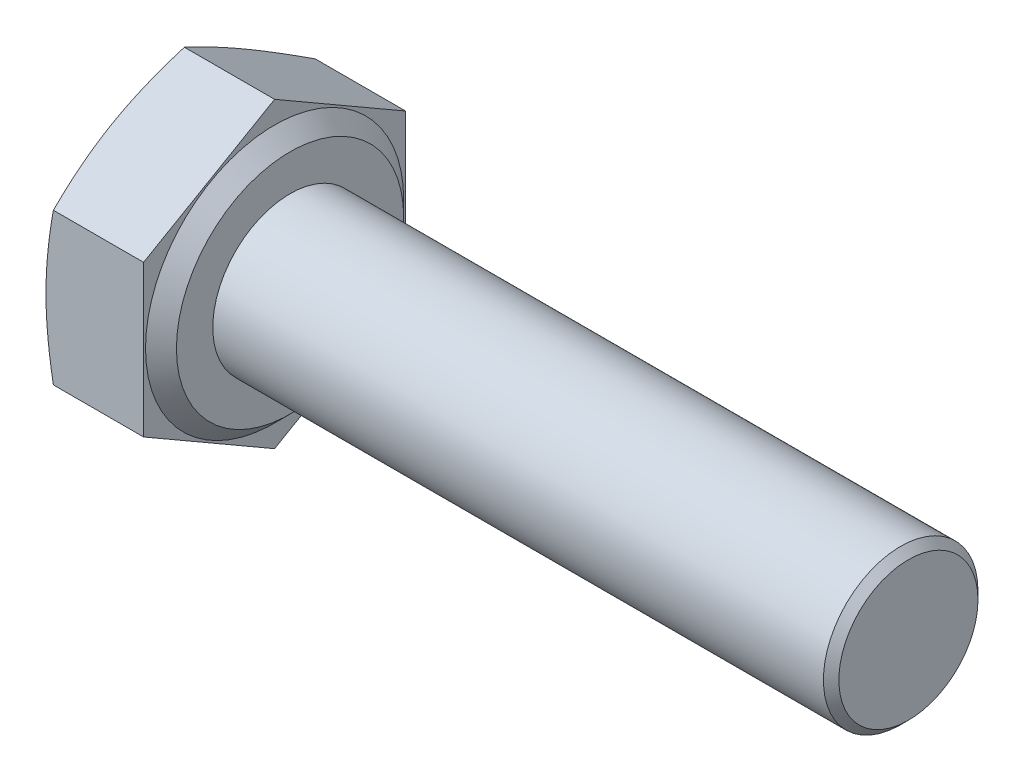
from build123d import *

# Parameters (mm, degrees)
BASEHEAD_DEPTH = 2.925
SKETCH5_R      = 2
BASEBODY_DEPTH = 16
CHAMFER1_SIZE  = 0.2


with BuildPart() as part:
    # Sketch2 → BaseHead (new body)
    with BuildSketch(Plane(origin=(0, 0, 0), x_dir=(0, 0, -1), z_dir=(1, 0, 0))):
        Polygon((3.39, -1.957217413), (3.39, 1.957217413), (0, 3.914434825), (-3.39, 1.957217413), (-3.39, -1.957217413), (0, -3.914434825), align=None)
    extrude(amount=BASEHEAD_DEPTH)

    # Sketch3 → BearingFace (revolve, cut)
    with BuildSketch(Plane.XY, mode=Mode.PRIVATE) as bearingface_sk:
        Polygon((2.925, 3.914434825), (2.925, 2.94), (2.525, 3.34), (2.525, 3.914434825), align=None)
    revolve(bearingface_sk.sketch.rotate(Axis((-0.957090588, 0, 0), (1, 0, 0)), 90), axis=Axis((-0.957090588, 0, 0), (1, 0, 0)), mode=Mode.SUBTRACT)

    # Sketch4 → HeadChamfer (revolve, cut)
    with BuildSketch(Plane.XY):
        Polygon((0, 3.914434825), (0.190878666, 3.914434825), (0, 3.39), align=None)
    revolve(axis=Axis((-0.493528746, 0, 0), (1, 0, 0)), mode=Mode.SUBTRACT)

    # Sketch5 → BaseBody (add)
    with BuildSketch(Plane(origin=(2.925, 0, 0), x_dir=(0, 0, -1), z_dir=(1, 0, 0))):
        Circle(SKETCH5_R)
    extrude(amount=BASEBODY_DEPTH)

    # Chamfer1
    chamfer1_edges = [part.edges().sort_by_distance(p)[0] for p in [
        (18.925, 0, 2),
    ]]
    chamfer(chamfer1_edges, length=CHAMFER1_SIZE)


solid = part.part
